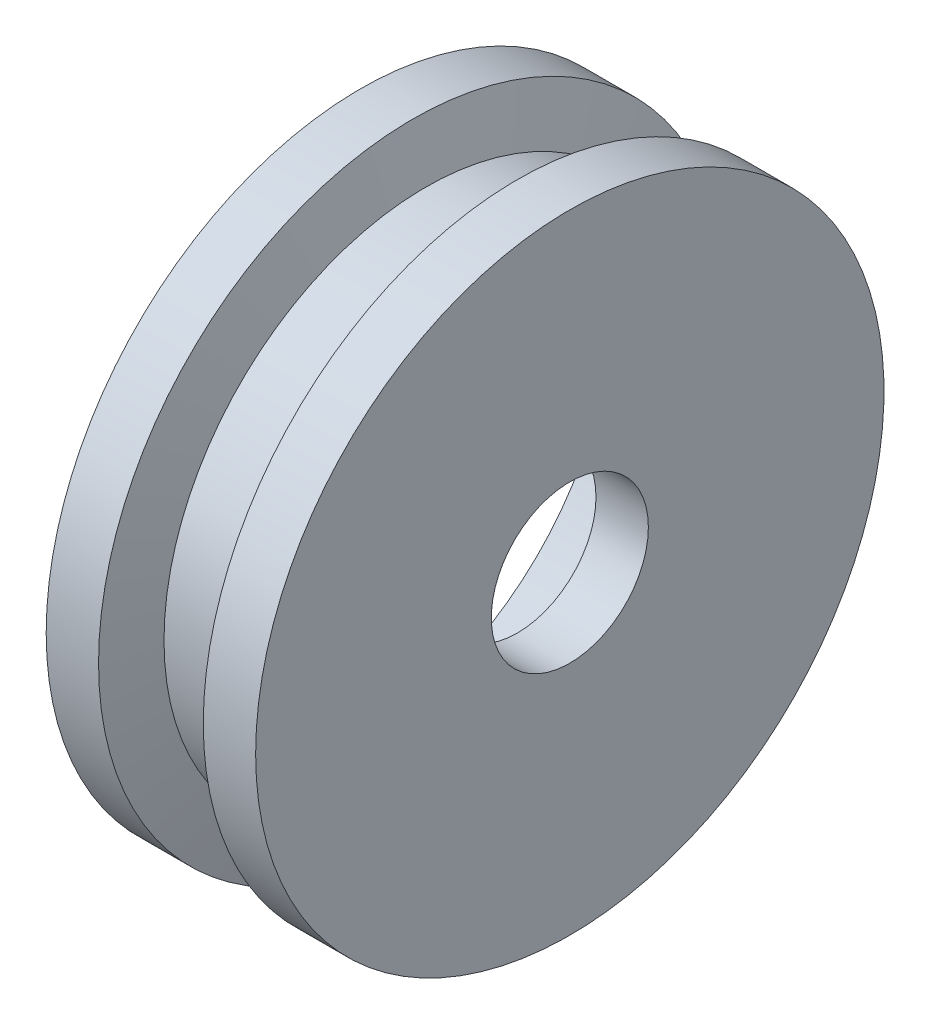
from build123d import *

# Parameters (mm, degrees)
ESQUISSE2_R             = 9.6
ENL_V_MAT_EXTRU_1_DEPTH = 6
ESQUISSE3_R             = 3
ENL_V_MAT_EXTRU_2_DEPTH = 8


with BuildPart() as part:
    # Esquisse1 → R_volution1 (revolve)
    with BuildSketch(Plane.XY, mode=Mode.PRIVATE) as r_volution1_sk:
        Polygon((-2, 12), (-1.5, 10), (1.5, 10), (2, 12), (4, 12), (4, 0), (-4, 0), (-4, 12), align=None)
    revolve(r_volution1_sk.sketch.rotate(Axis((-12.963264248, 0, 0), (1, 0, 0)), 90), axis=Axis((-12.963264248, 0, 0), (1, 0, 0)))

    # Esquisse2 → Enl_v. mat.-Extru.1 (cut)
    with BuildSketch(Plane.ZY.offset(4)):
        Circle(ESQUISSE2_R)
    extrude(amount=-ENL_V_MAT_EXTRU_1_DEPTH, mode=Mode.SUBTRACT)

    # Esquisse3 → Enl_v. mat.-Extru.2 (cut)
    with BuildSketch(Plane(origin=(4, 0, 0), x_dir=(0, 0, -1), z_dir=(1, 0, 0))):
        Circle(ESQUISSE3_R)
    extrude(amount=-ENL_V_MAT_EXTRU_2_DEPTH, mode=Mode.SUBTRACT)


solid = part.part
